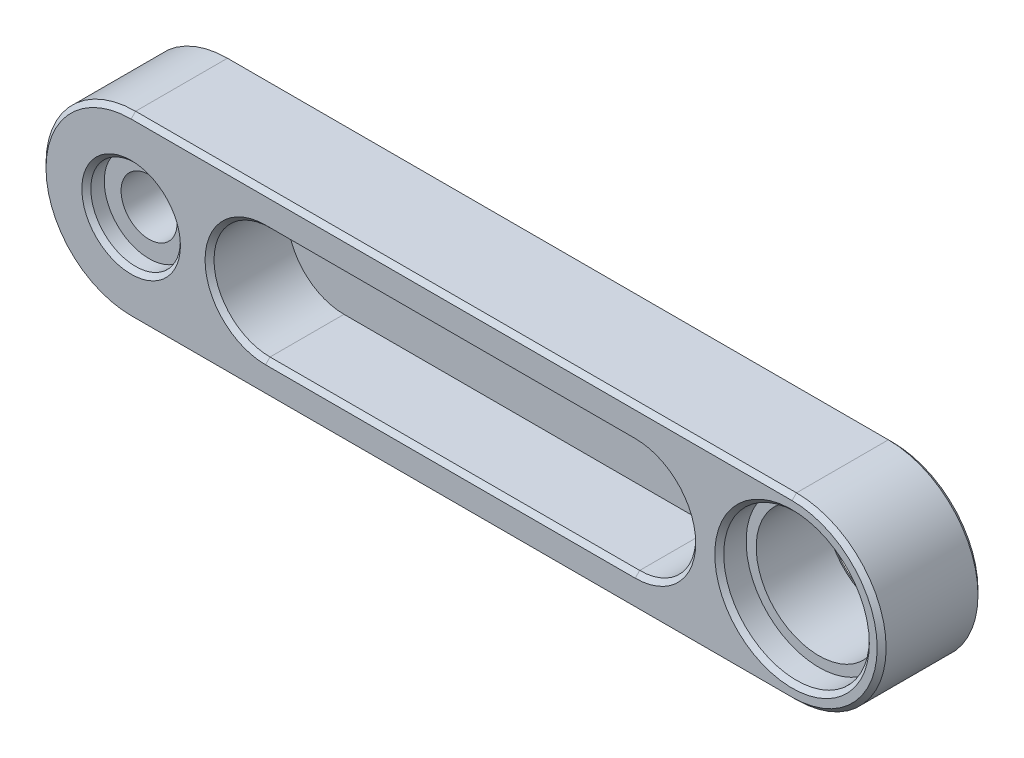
ISO-10303-21;
HEADER;
FILE_DESCRIPTION(('STEP AP214'),'2;1');
FILE_NAME('part.step','',(''),(''),'','','');
FILE_SCHEMA(('AUTOMOTIVE_DESIGN { 1 0 10303 214 1 1 1 1 }'));
ENDSEC;
DATA;
#1=APPLICATION_CONTEXT('core data for automotive mechanical design processes');
#2=APPLICATION_PROTOCOL_DEFINITION('international standard','automotive_design',2000,#1);
#3=PRODUCT_CONTEXT('',#1,'mechanical');
#4=PRODUCT('Part','Part','',(#3));
#5=PRODUCT_RELATED_PRODUCT_CATEGORY('part','',(#4));
#6=PRODUCT_DEFINITION_FORMATION('','',#4);
#7=PRODUCT_DEFINITION_CONTEXT('part definition',#1,'design');
#8=PRODUCT_DEFINITION('design','',#6,#7);
#9=PRODUCT_DEFINITION_SHAPE('','',#8);
#10=(LENGTH_UNIT() NAMED_UNIT(*) SI_UNIT(.MILLI.,.METRE.));
#11=(NAMED_UNIT(*) PLANE_ANGLE_UNIT() SI_UNIT($,.RADIAN.));
#12=(NAMED_UNIT(*) SI_UNIT($,.STERADIAN.) SOLID_ANGLE_UNIT());
#13=UNCERTAINTY_MEASURE_WITH_UNIT(LENGTH_MEASURE(1.E-05),#10,'distance_accuracy_value','');
#14=(GEOMETRIC_REPRESENTATION_CONTEXT(3) GLOBAL_UNCERTAINTY_ASSIGNED_CONTEXT((#13)) GLOBAL_UNIT_ASSIGNED_CONTEXT((#10,
#11,#12)) REPRESENTATION_CONTEXT('',''));
#15=CARTESIAN_POINT('',(0.,0.,0.));
#16=DIRECTION('',(0.,0.,1.));
#17=DIRECTION('',(1.,0.,0.));
#18=AXIS2_PLACEMENT_3D('',#15,#16,#17);
#19=CARTESIAN_POINT('',(0.,0.,1.));
#20=DIRECTION('',(0.,0.,1.));
#21=DIRECTION('',(1.,0.,0.));
#22=AXIS2_PLACEMENT_3D('',#19,#20,#21);
#23=PLANE('',#22);
#24=CARTESIAN_POINT('',(22.5,0.,1.));
#25=DIRECTION('',(0.,0.,1.));
#26=DIRECTION('',(1.,0.,0.));
#27=AXIS2_PLACEMENT_3D('',#24,#25,#26);
#28=CIRCLE('',#27,2.5);
#29=CARTESIAN_POINT('',(22.5,-2.5,1.));
#30=VERTEX_POINT('',#29);
#31=CARTESIAN_POINT('',(22.5,2.5,1.));
#32=VERTEX_POINT('',#31);
#33=EDGE_CURVE('E20',#30,#32,#28,.T.);
#34=ORIENTED_EDGE('',*,*,#33,.T.);
#35=DIRECTION('',(1.,0.,0.));
#36=VECTOR('',#35,1.);
#37=CARTESIAN_POINT('',(6.,2.5,1.));
#38=LINE('',#37,#36);
#39=CARTESIAN_POINT('',(6.,2.5,1.));
#40=VERTEX_POINT('',#39);
#41=EDGE_CURVE('E107',#32,#40,#38,.F.);
#42=ORIENTED_EDGE('',*,*,#41,.T.);
#43=CARTESIAN_POINT('',(6.,0.,1.));
#44=DIRECTION('',(0.,0.,1.));
#45=DIRECTION('',(1.,0.,0.));
#46=AXIS2_PLACEMENT_3D('',#43,#44,#45);
#47=CIRCLE('',#46,2.5);
#48=CARTESIAN_POINT('',(6.,-2.5,1.));
#49=VERTEX_POINT('',#48);
#50=EDGE_CURVE('E102',#40,#49,#47,.T.);
#51=ORIENTED_EDGE('',*,*,#50,.T.);
#52=DIRECTION('',(1.,0.,0.));
#53=VECTOR('',#52,1.);
#54=CARTESIAN_POINT('',(6.,-2.5,1.));
#55=LINE('',#54,#53);
#56=EDGE_CURVE('E95',#49,#30,#55,.T.);
#57=ORIENTED_EDGE('',*,*,#56,.T.);
#58=EDGE_LOOP('',(#34,#42,#51,#57));
#59=FACE_BOUND('',#58,.T.);
#60=ADVANCED_FACE('F17',(#59),#23,.T.);
#61=CARTESIAN_POINT('',(22.5,0.,-22.0737400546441));
#62=DIRECTION('',(0.,0.,1.));
#63=DIRECTION('',(1.,0.,0.));
#64=AXIS2_PLACEMENT_3D('',#61,#62,#63);
#65=CYLINDRICAL_SURFACE('',#64,2.5);
#66=ORIENTED_EDGE('',*,*,#33,.F.);
#67=DIRECTION('',(0.,0.,-1.));
#68=VECTOR('',#67,1.);
#69=CARTESIAN_POINT('',(22.5,-2.5,-22.0737400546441));
#70=LINE('',#69,#68);
#71=CARTESIAN_POINT('',(22.5,-2.49999999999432,4.30000000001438));
#72=VERTEX_POINT('',#71);
#73=EDGE_CURVE('E87',#30,#72,#70,.F.);
#74=ORIENTED_EDGE('',*,*,#73,.T.);
#75=CARTESIAN_POINT('',(22.5,0.,4.30000000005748));
#76=DIRECTION('',(0.,0.,1.));
#77=DIRECTION('',(1.,0.,0.));
#78=AXIS2_PLACEMENT_3D('',#75,#76,#77);
#79=CIRCLE('',#78,2.49999999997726);
#80=CARTESIAN_POINT('',(22.5,2.49999999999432,4.30000000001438));
#81=VERTEX_POINT('',#80);
#82=EDGE_CURVE('E168',#72,#81,#79,.T.);
#83=ORIENTED_EDGE('',*,*,#82,.T.);
#84=DIRECTION('',(0.,0.,1.));
#85=VECTOR('',#84,1.);
#86=CARTESIAN_POINT('',(22.5,2.5,-22.0737400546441));
#87=LINE('',#86,#85);
#88=EDGE_CURVE('E90',#81,#32,#87,.F.);
#89=ORIENTED_EDGE('',*,*,#88,.T.);
#90=EDGE_LOOP('',(#66,#74,#83,#89));
#91=FACE_BOUND('',#90,.T.);
#92=ADVANCED_FACE('F85',(#91),#65,.F.);
#93=CARTESIAN_POINT('',(6.,-2.5,-22.0737400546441));
#94=DIRECTION('',(0.,-1.,0.));
#95=DIRECTION('',(0.,0.,-1.));
#96=AXIS2_PLACEMENT_3D('',#93,#94,#95);
#97=PLANE('',#96);
#98=DIRECTION('',(1.,0.,0.));
#99=VECTOR('',#98,1.);
#100=CARTESIAN_POINT('',(6.,-2.5,4.30000000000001));
#101=LINE('',#100,#99);
#102=CARTESIAN_POINT('',(6.,-2.50000000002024,4.2999999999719));
#103=VERTEX_POINT('',#102);
#104=EDGE_CURVE('E101',#72,#103,#101,.F.);
#105=ORIENTED_EDGE('',*,*,#104,.F.);
#106=ORIENTED_EDGE('',*,*,#73,.F.);
#107=ORIENTED_EDGE('',*,*,#56,.F.);
#108=DIRECTION('',(0.,0.,1.));
#109=VECTOR('',#108,1.);
#110=CARTESIAN_POINT('',(6.,-2.5,-22.0737400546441));
#111=LINE('',#110,#109);
#112=EDGE_CURVE('E155',#49,#103,#111,.T.);
#113=ORIENTED_EDGE('',*,*,#112,.T.);
#114=EDGE_LOOP('',(#105,#106,#107,#113));
#115=FACE_BOUND('',#114,.T.);
#116=ADVANCED_FACE('F97',(#115),#97,.F.);
#117=CARTESIAN_POINT('',(6.,0.,-22.0737400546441));
#118=DIRECTION('',(0.,0.,1.));
#119=DIRECTION('',(1.,0.,0.));
#120=AXIS2_PLACEMENT_3D('',#117,#118,#119);
#121=CYLINDRICAL_SURFACE('',#120,2.5);
#122=CARTESIAN_POINT('',(6.,0.,4.29999999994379));
#123=DIRECTION('',(0.,0.,1.));
#124=DIRECTION('',(1.,0.,0.));
#125=AXIS2_PLACEMENT_3D('',#122,#123,#124);
#126=CIRCLE('',#125,2.50000000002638);
#127=CARTESIAN_POINT('',(6.,2.50000000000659,4.29999999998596));
#128=VERTEX_POINT('',#127);
#129=EDGE_CURVE('E183',#128,#103,#126,.T.);
#130=ORIENTED_EDGE('',*,*,#129,.T.);
#131=ORIENTED_EDGE('',*,*,#112,.F.);
#132=ORIENTED_EDGE('',*,*,#50,.F.);
#133=DIRECTION('',(0.,0.,1.));
#134=VECTOR('',#133,1.);
#135=CARTESIAN_POINT('',(6.,2.5,-22.0737400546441));
#136=LINE('',#135,#134);
#137=EDGE_CURVE('E159',#40,#128,#136,.T.);
#138=ORIENTED_EDGE('',*,*,#137,.T.);
#139=EDGE_LOOP('',(#130,#131,#132,#138));
#140=FACE_BOUND('',#139,.T.);
#141=ADVANCED_FACE('F665',(#140),#121,.F.);
#142=CARTESIAN_POINT('',(6.,2.5,-22.0737400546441));
#143=DIRECTION('',(0.,1.,0.));
#144=DIRECTION('',(0.,0.,1.));
#145=AXIS2_PLACEMENT_3D('',#142,#143,#144);
#146=PLANE('',#145);
#147=DIRECTION('',(1.,0.,0.));
#148=VECTOR('',#147,1.);
#149=CARTESIAN_POINT('',(6.,2.5,4.30000000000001));
#150=LINE('',#149,#148);
#151=EDGE_CURVE('E154',#128,#81,#150,.T.);
#152=ORIENTED_EDGE('',*,*,#151,.F.);
#153=ORIENTED_EDGE('',*,*,#137,.F.);
#154=ORIENTED_EDGE('',*,*,#41,.F.);
#155=ORIENTED_EDGE('',*,*,#88,.F.);
#156=EDGE_LOOP('',(#152,#153,#154,#155));
#157=FACE_BOUND('',#156,.T.);
#158=ADVANCED_FACE('F657',(#157),#146,.F.);
#159=CARTESIAN_POINT('',(22.5,0.,4.49999999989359));
#160=DIRECTION('',(0.,0.,1.));
#161=DIRECTION('',(1.,0.,0.));
#162=AXIS2_PLACEMENT_3D('',#159,#160,#161);
#163=CONICAL_SURFACE('',#162,2.69999999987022,0.785398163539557);
#164=ORIENTED_EDGE('',*,*,#82,.F.);
#165=DIRECTION('',(0.,-0.707106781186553,0.707106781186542));
#166=VECTOR('',#165,1.);
#167=CARTESIAN_POINT('',(22.5,-2.5,4.30000000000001));
#168=LINE('',#167,#166);
#169=CARTESIAN_POINT('',(22.5,-2.69999999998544,4.49999999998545));
#170=VERTEX_POINT('',#169);
#171=EDGE_CURVE('E169',#170,#72,#168,.F.);
#172=ORIENTED_EDGE('',*,*,#171,.F.);
#173=CARTESIAN_POINT('',(22.5,0.,4.4999999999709));
#174=DIRECTION('',(0.,0.,1.));
#175=DIRECTION('',(1.,0.,0.));
#176=AXIS2_PLACEMENT_3D('',#173,#174,#175);
#177=CIRCLE('',#176,2.69999999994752);
#178=CARTESIAN_POINT('',(22.5,2.69999999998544,4.49999999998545));
#179=VERTEX_POINT('',#178);
#180=EDGE_CURVE('E153',#179,#170,#177,.F.);
#181=ORIENTED_EDGE('',*,*,#180,.F.);
#182=DIRECTION('',(0.,-0.707106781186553,-0.707106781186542));
#183=VECTOR('',#182,1.);
#184=CARTESIAN_POINT('',(22.5,2.5,4.30000000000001));
#185=LINE('',#184,#183);
#186=EDGE_CURVE('E191',#81,#179,#185,.F.);
#187=ORIENTED_EDGE('',*,*,#186,.F.);
#188=EDGE_LOOP('',(#164,#172,#181,#187));
#189=FACE_BOUND('',#188,.T.);
#190=ADVANCED_FACE('F368',(#189),#163,.F.);
#191=CARTESIAN_POINT('',(6.,-2.5,4.30000000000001));
#192=DIRECTION('',(0.,0.707106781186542,0.707106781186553));
#193=DIRECTION('',(0.,-0.707106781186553,0.707106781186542));
#194=AXIS2_PLACEMENT_3D('',#191,#192,#193);
#195=PLANE('',#194);
#196=ORIENTED_EDGE('',*,*,#171,.T.);
#197=ORIENTED_EDGE('',*,*,#104,.T.);
#198=DIRECTION('',(0.,0.707106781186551,-0.707106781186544));
#199=VECTOR('',#198,1.);
#200=CARTESIAN_POINT('',(5.99999999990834,-498994.,498995.799999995));
#201=LINE('',#200,#199);
#202=CARTESIAN_POINT('',(6.,-2.7000000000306,4.49999999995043));
#203=VERTEX_POINT('',#202);
#204=EDGE_CURVE('E187',#103,#203,#201,.F.);
#205=ORIENTED_EDGE('',*,*,#204,.T.);
#206=DIRECTION('',(1.,0.,0.));
#207=VECTOR('',#206,1.);
#208=CARTESIAN_POINT('',(0.,-2.69999999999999,4.5));
#209=LINE('',#208,#207);
#210=EDGE_CURVE('E152',#170,#203,#209,.F.);
#211=ORIENTED_EDGE('',*,*,#210,.F.);
#212=EDGE_LOOP('',(#196,#197,#205,#211));
#213=FACE_BOUND('',#212,.T.);
#214=ADVANCED_FACE('F370',(#213),#195,.T.);
#215=CARTESIAN_POINT('',(6.,0.,4.49999999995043));
#216=DIRECTION('',(0.,0.,1.));
#217=DIRECTION('',(1.,0.,0.));
#218=AXIS2_PLACEMENT_3D('',#215,#216,#217);
#219=CONICAL_SURFACE('',#218,2.70000000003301,0.785398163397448);
#220=CARTESIAN_POINT('',(6.,0.,4.49999999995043));
#221=DIRECTION('',(0.,0.,1.));
#222=DIRECTION('',(1.,0.,0.));
#223=AXIS2_PLACEMENT_3D('',#220,#221,#222);
#224=CIRCLE('',#223,2.70000000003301);
#225=CARTESIAN_POINT('',(6.,2.69999999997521,4.49999999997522));
#226=VERTEX_POINT('',#225);
#227=EDGE_CURVE('E150',#203,#226,#224,.F.);
#228=ORIENTED_EDGE('',*,*,#227,.F.);
#229=ORIENTED_EDGE('',*,*,#204,.F.);
#230=ORIENTED_EDGE('',*,*,#129,.F.);
#231=DIRECTION('',(0.,-0.707106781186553,-0.707106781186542));
#232=VECTOR('',#231,1.);
#233=CARTESIAN_POINT('',(6.,2.5,4.30000000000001));
#234=LINE('',#233,#232);
#235=EDGE_CURVE('E200',#226,#128,#234,.T.);
#236=ORIENTED_EDGE('',*,*,#235,.F.);
#237=EDGE_LOOP('',(#228,#229,#230,#236));
#238=FACE_BOUND('',#237,.T.);
#239=ADVANCED_FACE('F378',(#238),#219,.F.);
#240=CARTESIAN_POINT('',(6.,2.5,4.30000000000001));
#241=DIRECTION('',(0.,-0.707106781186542,0.707106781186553));
#242=DIRECTION('',(0.,-0.707106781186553,-0.707106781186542));
#243=AXIS2_PLACEMENT_3D('',#240,#241,#242);
#244=PLANE('',#243);
#245=ORIENTED_EDGE('',*,*,#235,.T.);
#246=ORIENTED_EDGE('',*,*,#151,.T.);
#247=ORIENTED_EDGE('',*,*,#186,.T.);
#248=DIRECTION('',(1.,0.,0.));
#249=VECTOR('',#248,1.);
#250=CARTESIAN_POINT('',(0.,2.69999999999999,4.5));
#251=LINE('',#250,#249);
#252=EDGE_CURVE('E149',#226,#179,#251,.T.);
#253=ORIENTED_EDGE('',*,*,#252,.F.);
#254=EDGE_LOOP('',(#245,#246,#247,#253));
#255=FACE_BOUND('',#254,.T.);
#256=ADVANCED_FACE('F375',(#255),#244,.T.);
#257=CARTESIAN_POINT('',(29.5,0.,4.50000000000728));
#258=DIRECTION('',(0.,0.,1.));
#259=DIRECTION('',(1.,0.,0.));
#260=AXIS2_PLACEMENT_3D('',#257,#258,#259);
#261=CONICAL_SURFACE('',#260,3.45000000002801,0.785398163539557);
#262=CARTESIAN_POINT('',(29.5,0.,4.4999999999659));
#263=DIRECTION('',(0.,0.,1.));
#264=DIRECTION('',(1.,0.,0.));
#265=AXIS2_PLACEMENT_3D('',#262,#263,#264);
#266=CIRCLE('',#265,3.44999999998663);
#267=CARTESIAN_POINT('',(32.9499999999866,0.,4.4999999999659));
#268=VERTEX_POINT('',#267);
#269=EDGE_CURVE('E142',#268,#268,#266,.F.);
#270=ORIENTED_EDGE('',*,*,#269,.F.);
#271=EDGE_LOOP('',(#270));
#272=FACE_BOUND('',#271,.T.);
#273=CARTESIAN_POINT('',(29.5,0.,4.30000000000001));
#274=DIRECTION('',(0.,0.,1.));
#275=DIRECTION('',(1.,0.,0.));
#276=AXIS2_PLACEMENT_3D('',#273,#274,#275);
#277=CIRCLE('',#276,3.25);
#278=CARTESIAN_POINT('',(32.75,0.,4.30000000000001));
#279=VERTEX_POINT('',#278);
#280=EDGE_CURVE('E145',#279,#279,#277,.F.);
#281=ORIENTED_EDGE('',*,*,#280,.T.);
#282=EDGE_LOOP('',(#281));
#283=FACE_BOUND('',#282,.T.);
#284=ADVANCED_FACE('F377',(#272,#283),#261,.F.);
#285=CARTESIAN_POINT('',(0.,0.,4.50000000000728));
#286=DIRECTION('',(0.,0.,1.));
#287=DIRECTION('',(1.,0.,0.));
#288=AXIS2_PLACEMENT_3D('',#285,#286,#287);
#289=CONICAL_SURFACE('',#288,2.19999999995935,0.785398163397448);
#290=CARTESIAN_POINT('',(0.,0.,4.50000000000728));
#291=DIRECTION('',(0.,0.,1.));
#292=DIRECTION('',(1.,0.,0.));
#293=AXIS2_PLACEMENT_3D('',#290,#291,#292);
#294=CIRCLE('',#293,2.19999999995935);
#295=CARTESIAN_POINT('',(2.19999999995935,0.,4.50000000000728));
#296=VERTEX_POINT('',#295);
#297=EDGE_CURVE('E146',#296,#296,#294,.F.);
#298=ORIENTED_EDGE('',*,*,#297,.F.);
#299=EDGE_LOOP('',(#298));
#300=FACE_BOUND('',#299,.T.);
#301=CARTESIAN_POINT('',(0.,0.,4.3));
#302=DIRECTION('',(0.,0.,1.));
#303=DIRECTION('',(1.,0.,0.));
#304=AXIS2_PLACEMENT_3D('',#301,#302,#303);
#305=CIRCLE('',#304,2.);
#306=CARTESIAN_POINT('',(2.,0.,4.3));
#307=VERTEX_POINT('',#306);
#308=EDGE_CURVE('E219',#307,#307,#305,.F.);
#309=ORIENTED_EDGE('',*,*,#308,.T.);
#310=EDGE_LOOP('',(#309));
#311=FACE_BOUND('',#310,.T.);
#312=ADVANCED_FACE('F385',(#300,#311),#289,.F.);
#313=CARTESIAN_POINT('',(0.,0.,4.5));
#314=DIRECTION('',(0.,0.,1.));
#315=DIRECTION('',(1.,0.,0.));
#316=AXIS2_PLACEMENT_3D('',#313,#314,#315);
#317=PLANE('',#316);
#318=ORIENTED_EDGE('',*,*,#269,.T.);
#319=EDGE_LOOP('',(#318));
#320=FACE_BOUND('',#319,.T.);
#321=ORIENTED_EDGE('',*,*,#297,.T.);
#322=EDGE_LOOP('',(#321));
#323=FACE_BOUND('',#322,.T.);
#324=ORIENTED_EDGE('',*,*,#227,.T.);
#325=ORIENTED_EDGE('',*,*,#252,.T.);
#326=ORIENTED_EDGE('',*,*,#180,.T.);
#327=ORIENTED_EDGE('',*,*,#210,.T.);
#328=EDGE_LOOP('',(#324,#325,#326,#327));
#329=FACE_BOUND('',#328,.T.);
#330=CARTESIAN_POINT('',(0.,0.,4.50000000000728));
#331=DIRECTION('',(0.,0.,-1.));
#332=DIRECTION('',(-1.,0.,0.));
#333=AXIS2_PLACEMENT_3D('',#330,#331,#332);
#334=CIRCLE('',#333,3.80000000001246);
#335=CARTESIAN_POINT('',(0.,-3.79999999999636,4.50000000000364));
#336=VERTEX_POINT('',#335);
#337=CARTESIAN_POINT('',(0.,3.80000000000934,4.50000000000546));
#338=VERTEX_POINT('',#337);
#339=EDGE_CURVE('E138',#336,#338,#334,.T.);
#340=ORIENTED_EDGE('',*,*,#339,.F.);
#341=DIRECTION('',(1.,0.,0.));
#342=VECTOR('',#341,1.);
#343=CARTESIAN_POINT('',(0.,-3.79999999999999,4.5));
#344=LINE('',#343,#342);
#345=CARTESIAN_POINT('',(29.5,-3.79999999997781,4.50000000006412));
#346=VERTEX_POINT('',#345);
#347=EDGE_CURVE('E222',#346,#336,#344,.F.);
#348=ORIENTED_EDGE('',*,*,#347,.F.);
#349=CARTESIAN_POINT('',(29.5,0.,4.50000000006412));
#350=DIRECTION('',(0.,0.,-1.));
#351=DIRECTION('',(-1.,0.,0.));
#352=AXIS2_PLACEMENT_3D('',#349,#350,#351);
#353=CIRCLE('',#352,3.79999999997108);
#354=CARTESIAN_POINT('',(29.5,3.79999999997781,4.50000000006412));
#355=VERTEX_POINT('',#354);
#356=EDGE_CURVE('E134',#355,#346,#353,.T.);
#357=ORIENTED_EDGE('',*,*,#356,.F.);
#358=DIRECTION('',(1.,0.,0.));
#359=VECTOR('',#358,1.);
#360=CARTESIAN_POINT('',(0.,3.79999999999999,4.5));
#361=LINE('',#360,#359);
#362=EDGE_CURVE('E141',#338,#355,#361,.T.);
#363=ORIENTED_EDGE('',*,*,#362,.F.);
#364=EDGE_LOOP('',(#340,#348,#357,#363));
#365=FACE_BOUND('',#364,.T.);
#366=ADVANCED_FACE('F373',(#320,#323,#329,#365),#317,.T.);
#367=CARTESIAN_POINT('',(29.5,0.,3.5));
#368=DIRECTION('',(0.,0.,1.));
#369=DIRECTION('',(1.,0.,0.));
#370=AXIS2_PLACEMENT_3D('',#367,#368,#369);
#371=CYLINDRICAL_SURFACE('',#370,3.25);
#372=ORIENTED_EDGE('',*,*,#280,.F.);
#373=EDGE_LOOP('',(#372));
#374=FACE_BOUND('',#373,.T.);
#375=CARTESIAN_POINT('',(29.5,0.,3.3));
#376=DIRECTION('',(0.,0.,1.));
#377=DIRECTION('',(1.,0.,0.));
#378=AXIS2_PLACEMENT_3D('',#375,#376,#377);
#379=CIRCLE('',#378,3.25);
#380=CARTESIAN_POINT('',(32.75,0.,3.3));
#381=VERTEX_POINT('',#380);
#382=EDGE_CURVE('E131',#381,#381,#379,.T.);
#383=ORIENTED_EDGE('',*,*,#382,.F.);
#384=EDGE_LOOP('',(#383));
#385=FACE_BOUND('',#384,.T.);
#386=ADVANCED_FACE('F465',(#374,#385),#371,.F.);
#387=CARTESIAN_POINT('',(0.,0.,3.7));
#388=DIRECTION('',(0.,0.,1.));
#389=DIRECTION('',(1.,0.,0.));
#390=AXIS2_PLACEMENT_3D('',#387,#388,#389);
#391=CYLINDRICAL_SURFACE('',#390,2.);
#392=ORIENTED_EDGE('',*,*,#308,.F.);
#393=EDGE_LOOP('',(#392));
#394=FACE_BOUND('',#393,.T.);
#395=CARTESIAN_POINT('',(0.,0.,3.7));
#396=DIRECTION('',(0.,0.,1.));
#397=DIRECTION('',(1.,0.,0.));
#398=AXIS2_PLACEMENT_3D('',#395,#396,#397);
#399=CIRCLE('',#398,2.);
#400=CARTESIAN_POINT('',(2.,0.,3.7));
#401=VERTEX_POINT('',#400);
#402=EDGE_CURVE('E127',#401,#401,#399,.T.);
#403=ORIENTED_EDGE('',*,*,#402,.F.);
#404=EDGE_LOOP('',(#403));
#405=FACE_BOUND('',#404,.T.);
#406=ADVANCED_FACE('F461',(#394,#405),#391,.F.);
#407=CARTESIAN_POINT('',(0.,3.79999999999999,4.5));
#408=DIRECTION('',(0.,0.707106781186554,0.707106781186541));
#409=DIRECTION('',(0.,-0.707106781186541,0.707106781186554));
#410=AXIS2_PLACEMENT_3D('',#407,#408,#409);
#411=PLANE('',#410);
#412=DIRECTION('',(0.,-0.707106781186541,0.707106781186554));
#413=VECTOR('',#412,1.);
#414=CARTESIAN_POINT('',(-3.05549376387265E-11,499000.,-498991.700000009));
#415=LINE('',#414,#413);
#416=CARTESIAN_POINT('',(0.,3.99999999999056,4.30000000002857));
#417=VERTEX_POINT('',#416);
#418=EDGE_CURVE('E140',#338,#417,#415,.F.);
#419=ORIENTED_EDGE('',*,*,#418,.F.);
#420=ORIENTED_EDGE('',*,*,#362,.T.);
#421=DIRECTION('',(0.,-0.707106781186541,0.707106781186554));
#422=VECTOR('',#421,1.);
#423=CARTESIAN_POINT('',(29.4999999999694,499008.299999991,-499000.));
#424=LINE('',#423,#422);
#425=CARTESIAN_POINT('',(29.5,4.00000000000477,4.30000000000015));
#426=VERTEX_POINT('',#425);
#427=EDGE_CURVE('E137',#426,#355,#424,.T.);
#428=ORIENTED_EDGE('',*,*,#427,.F.);
#429=DIRECTION('',(1.,0.,0.));
#430=VECTOR('',#429,1.);
#431=CARTESIAN_POINT('',(0.,4.,4.29999999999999));
#432=LINE('',#431,#430);
#433=EDGE_CURVE('E130',#426,#417,#432,.F.);
#434=ORIENTED_EDGE('',*,*,#433,.T.);
#435=EDGE_LOOP('',(#419,#420,#428,#434));
#436=FACE_BOUND('',#435,.T.);
#437=ADVANCED_FACE('F457',(#436),#411,.T.);
#438=CARTESIAN_POINT('',(0.,0.,4.30000000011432));
#439=DIRECTION('',(0.,0.,-1.));
#440=DIRECTION('',(-1.,0.,0.));
#441=AXIS2_PLACEMENT_3D('',#438,#439,#440);
#442=CONICAL_SURFACE('',#441,3.99999999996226,0.785398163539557);
#443=ORIENTED_EDGE('',*,*,#418,.T.);
#444=CARTESIAN_POINT('',(0.,0.,4.29999999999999));
#445=DIRECTION('',(0.,0.,-1.));
#446=DIRECTION('',(-1.,0.,0.));
#447=AXIS2_PLACEMENT_3D('',#444,#445,#446);
#448=CIRCLE('',#447,4.);
#449=CARTESIAN_POINT('',(0.,-4.,4.29999999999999));
#450=VERTEX_POINT('',#449);
#451=EDGE_CURVE('E237',#450,#417,#448,.T.);
#452=ORIENTED_EDGE('',*,*,#451,.F.);
#453=DIRECTION('',(0.,-0.707106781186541,-0.707106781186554));
#454=VECTOR('',#453,1.);
#455=CARTESIAN_POINT('',(0.,-3.79999999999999,4.5));
#456=LINE('',#455,#454);
#457=EDGE_CURVE('E226',#336,#450,#456,.T.);
#458=ORIENTED_EDGE('',*,*,#457,.F.);
#459=ORIENTED_EDGE('',*,*,#339,.T.);
#460=EDGE_LOOP('',(#443,#452,#458,#459));
#461=FACE_BOUND('',#460,.T.);
#462=ADVANCED_FACE('F453',(#461),#442,.T.);
#463=CARTESIAN_POINT('',(0.,-3.79999999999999,4.5));
#464=DIRECTION('',(0.,-0.707106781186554,0.707106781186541));
#465=DIRECTION('',(0.,-0.707106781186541,-0.707106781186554));
#466=AXIS2_PLACEMENT_3D('',#463,#464,#465);
#467=PLANE('',#466);
#468=DIRECTION('',(0.,0.707106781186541,0.707106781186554));
#469=VECTOR('',#468,1.);
#470=CARTESIAN_POINT('',(29.5000000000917,-499008.299999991,-499000.));
#471=LINE('',#470,#469);
#472=CARTESIAN_POINT('',(29.5,-4.00000000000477,4.30000000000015));
#473=VERTEX_POINT('',#472);
#474=EDGE_CURVE('E225',#346,#473,#471,.F.);
#475=ORIENTED_EDGE('',*,*,#474,.F.);
#476=ORIENTED_EDGE('',*,*,#347,.T.);
#477=ORIENTED_EDGE('',*,*,#457,.T.);
#478=DIRECTION('',(1.,0.,0.));
#479=VECTOR('',#478,1.);
#480=CARTESIAN_POINT('',(0.,-4.,4.29999999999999));
#481=LINE('',#480,#479);
#482=EDGE_CURVE('E251',#450,#473,#481,.T.);
#483=ORIENTED_EDGE('',*,*,#482,.T.);
#484=EDGE_LOOP('',(#475,#476,#477,#483));
#485=FACE_BOUND('',#484,.T.);
#486=ADVANCED_FACE('F449',(#485),#467,.T.);
#487=CARTESIAN_POINT('',(29.5,0.,4.30000000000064));
#488=DIRECTION('',(0.,0.,-1.));
#489=DIRECTION('',(-1.,0.,0.));
#490=AXIS2_PLACEMENT_3D('',#487,#488,#489);
#491=CONICAL_SURFACE('',#490,4.00000000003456,0.785398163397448);
#492=ORIENTED_EDGE('',*,*,#427,.T.);
#493=ORIENTED_EDGE('',*,*,#356,.T.);
#494=ORIENTED_EDGE('',*,*,#474,.T.);
#495=CARTESIAN_POINT('',(29.5,0.,4.29999999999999));
#496=DIRECTION('',(0.,0.,-1.));
#497=DIRECTION('',(-1.,0.,0.));
#498=AXIS2_PLACEMENT_3D('',#495,#496,#497);
#499=CIRCLE('',#498,4.);
#500=EDGE_CURVE('E126',#426,#473,#499,.T.);
#501=ORIENTED_EDGE('',*,*,#500,.F.);
#502=EDGE_LOOP('',(#492,#493,#494,#501));
#503=FACE_BOUND('',#502,.T.);
#504=ADVANCED_FACE('F445',(#503),#491,.T.);
#505=CARTESIAN_POINT('',(29.5,0.,3.3));
#506=DIRECTION('',(0.,0.,1.));
#507=DIRECTION('',(1.,0.,0.));
#508=AXIS2_PLACEMENT_3D('',#505,#506,#507);
#509=PLANE('',#508);
#510=CARTESIAN_POINT('',(29.5,0.,3.3));
#511=DIRECTION('',(0.,0.,1.));
#512=DIRECTION('',(1.,0.,0.));
#513=AXIS2_PLACEMENT_3D('',#510,#511,#512);
#514=CIRCLE('',#513,2.8);
#515=CARTESIAN_POINT('',(32.3,0.,3.3));
#516=VERTEX_POINT('',#515);
#517=EDGE_CURVE('E123',#516,#516,#514,.F.);
#518=ORIENTED_EDGE('',*,*,#517,.T.);
#519=EDGE_LOOP('',(#518));
#520=FACE_BOUND('',#519,.T.);
#521=ORIENTED_EDGE('',*,*,#382,.T.);
#522=EDGE_LOOP('',(#521));
#523=FACE_BOUND('',#522,.T.);
#524=ADVANCED_FACE('F441',(#520,#523),#509,.T.);
#525=CARTESIAN_POINT('',(0.,0.,3.7));
#526=DIRECTION('',(0.,0.,1.));
#527=DIRECTION('',(1.,0.,0.));
#528=AXIS2_PLACEMENT_3D('',#525,#526,#527);
#529=PLANE('',#528);
#530=ORIENTED_EDGE('',*,*,#402,.T.);
#531=EDGE_LOOP('',(#530));
#532=FACE_BOUND('',#531,.T.);
#533=CARTESIAN_POINT('',(0.,0.,3.7));
#534=DIRECTION('',(0.,0.,1.));
#535=DIRECTION('',(1.,0.,0.));
#536=AXIS2_PLACEMENT_3D('',#533,#534,#535);
#537=CIRCLE('',#536,1.24999999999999);
#538=CARTESIAN_POINT('',(1.24999999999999,0.,3.7));
#539=VERTEX_POINT('',#538);
#540=EDGE_CURVE('E119',#539,#539,#537,.F.);
#541=ORIENTED_EDGE('',*,*,#540,.T.);
#542=EDGE_LOOP('',(#541));
#543=FACE_BOUND('',#542,.T.);
#544=ADVANCED_FACE('F437',(#532,#543),#529,.T.);
#545=CARTESIAN_POINT('',(0.,4.,4.5));
#546=DIRECTION('',(0.,-1.,0.));
#547=DIRECTION('',(0.,0.,-1.));
#548=AXIS2_PLACEMENT_3D('',#545,#546,#547);
#549=PLANE('',#548);
#550=DIRECTION('',(1.,0.,0.));
#551=VECTOR('',#550,1.);
#552=CARTESIAN_POINT('',(0.,4.,0.200000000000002));
#553=LINE('',#552,#551);
#554=CARTESIAN_POINT('',(29.5,3.99999999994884,0.199999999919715));
#555=VERTEX_POINT('',#554);
#556=CARTESIAN_POINT('',(0.,4.00000000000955,0.200000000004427));
#557=VERTEX_POINT('',#556);
#558=EDGE_CURVE('E122',#555,#557,#553,.F.);
#559=ORIENTED_EDGE('',*,*,#558,.T.);
#560=DIRECTION('',(0.,0.,-1.));
#561=VECTOR('',#560,1.);
#562=CARTESIAN_POINT('',(0.,4.,4.5));
#563=LINE('',#562,#561);
#564=EDGE_CURVE('E240',#417,#557,#563,.T.);
#565=ORIENTED_EDGE('',*,*,#564,.F.);
#566=ORIENTED_EDGE('',*,*,#433,.F.);
#567=DIRECTION('',(0.,0.,-1.));
#568=VECTOR('',#567,1.);
#569=CARTESIAN_POINT('',(29.5,4.,4.5));
#570=LINE('',#569,#568);
#571=EDGE_CURVE('E259',#555,#426,#570,.F.);
#572=ORIENTED_EDGE('',*,*,#571,.F.);
#573=EDGE_LOOP('',(#559,#565,#566,#572));
#574=FACE_BOUND('',#573,.T.);
#575=ADVANCED_FACE('F434',(#574),#549,.F.);
#576=CARTESIAN_POINT('',(0.,0.,4.5));
#577=DIRECTION('',(0.,0.,-1.));
#578=DIRECTION('',(-1.,0.,0.));
#579=AXIS2_PLACEMENT_3D('',#576,#577,#578);
#580=CYLINDRICAL_SURFACE('',#579,4.);
#581=ORIENTED_EDGE('',*,*,#564,.T.);
#582=CARTESIAN_POINT('',(0.,0.,0.200000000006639));
#583=DIRECTION('',(0.,0.,1.));
#584=DIRECTION('',(1.,0.,0.));
#585=AXIS2_PLACEMENT_3D('',#582,#583,#584);
#586=CIRCLE('',#585,4.0000000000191);
#587=CARTESIAN_POINT('',(0.,-4.00000000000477,0.200000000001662));
#588=VERTEX_POINT('',#587);
#589=EDGE_CURVE('E274',#588,#557,#586,.F.);
#590=ORIENTED_EDGE('',*,*,#589,.F.);
#591=DIRECTION('',(0.,0.,1.));
#592=VECTOR('',#591,1.);
#593=CARTESIAN_POINT('',(0.,-4.,4.5));
#594=LINE('',#593,#592);
#595=EDGE_CURVE('E254',#588,#450,#594,.T.);
#596=ORIENTED_EDGE('',*,*,#595,.T.);
#597=ORIENTED_EDGE('',*,*,#451,.T.);
#598=EDGE_LOOP('',(#581,#590,#596,#597));
#599=FACE_BOUND('',#598,.T.);
#600=ADVANCED_FACE('F430',(#599),#580,.T.);
#601=CARTESIAN_POINT('',(0.,-4.,4.5));
#602=DIRECTION('',(0.,1.,0.));
#603=DIRECTION('',(0.,0.,1.));
#604=AXIS2_PLACEMENT_3D('',#601,#602,#603);
#605=PLANE('',#604);
#606=DIRECTION('',(1.,0.,0.));
#607=VECTOR('',#606,1.);
#608=CARTESIAN_POINT('',(0.,-4.,0.200000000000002));
#609=LINE('',#608,#607);
#610=CARTESIAN_POINT('',(29.5,-3.99999999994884,0.199999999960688));
#611=VERTEX_POINT('',#610);
#612=EDGE_CURVE('E277',#588,#611,#609,.T.);
#613=ORIENTED_EDGE('',*,*,#612,.T.);
#614=DIRECTION('',(0.,0.,-1.));
#615=VECTOR('',#614,1.);
#616=CARTESIAN_POINT('',(29.5,-4.,4.5));
#617=LINE('',#616,#615);
#618=EDGE_CURVE('E283',#473,#611,#617,.T.);
#619=ORIENTED_EDGE('',*,*,#618,.F.);
#620=ORIENTED_EDGE('',*,*,#482,.F.);
#621=ORIENTED_EDGE('',*,*,#595,.F.);
#622=EDGE_LOOP('',(#613,#619,#620,#621));
#623=FACE_BOUND('',#622,.T.);
#624=ADVANCED_FACE('F426',(#623),#605,.F.);
#625=CARTESIAN_POINT('',(29.5,0.,4.5));
#626=DIRECTION('',(0.,0.,-1.));
#627=DIRECTION('',(-1.,0.,0.));
#628=AXIS2_PLACEMENT_3D('',#625,#626,#627);
#629=CYLINDRICAL_SURFACE('',#628,4.);
#630=ORIENTED_EDGE('',*,*,#571,.T.);
#631=ORIENTED_EDGE('',*,*,#500,.T.);
#632=ORIENTED_EDGE('',*,*,#618,.T.);
#633=CARTESIAN_POINT('',(29.5,0.,0.200000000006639));
#634=DIRECTION('',(0.,0.,1.));
#635=DIRECTION('',(1.,0.,0.));
#636=AXIS2_PLACEMENT_3D('',#633,#634,#635);
#637=CIRCLE('',#636,3.99999999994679);
#638=EDGE_CURVE('E295',#555,#611,#637,.F.);
#639=ORIENTED_EDGE('',*,*,#638,.F.);
#640=EDGE_LOOP('',(#630,#631,#632,#639));
#641=FACE_BOUND('',#640,.T.);
#642=ADVANCED_FACE('F422',(#641),#629,.T.);
#643=CARTESIAN_POINT('',(29.5,0.,0.));
#644=DIRECTION('',(0.,0.,1.));
#645=DIRECTION('',(1.,0.,0.));
#646=AXIS2_PLACEMENT_3D('',#643,#644,#645);
#647=CYLINDRICAL_SURFACE('',#646,2.8);
#648=ORIENTED_EDGE('',*,*,#517,.F.);
#649=EDGE_LOOP('',(#648));
#650=FACE_BOUND('',#649,.T.);
#651=CARTESIAN_POINT('',(29.5,0.,0.200000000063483));
#652=DIRECTION('',(0.,0.,-1.));
#653=DIRECTION('',(-1.,0.,0.));
#654=AXIS2_PLACEMENT_3D('',#651,#652,#653);
#655=CIRCLE('',#654,2.79999999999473);
#656=CARTESIAN_POINT('',(26.7000000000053,0.,0.200000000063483));
#657=VERTEX_POINT('',#656);
#658=EDGE_CURVE('E297',#657,#657,#655,.T.);
#659=ORIENTED_EDGE('',*,*,#658,.T.);
#660=EDGE_LOOP('',(#659));
#661=FACE_BOUND('',#660,.T.);
#662=ADVANCED_FACE('F418',(#650,#661),#647,.F.);
#663=CARTESIAN_POINT('',(0.,0.,4.5));
#664=DIRECTION('',(0.,0.,1.));
#665=DIRECTION('',(1.,0.,0.));
#666=AXIS2_PLACEMENT_3D('',#663,#664,#665);
#667=CYLINDRICAL_SURFACE('',#666,1.24999999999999);
#668=ORIENTED_EDGE('',*,*,#540,.F.);
#669=EDGE_LOOP('',(#668));
#670=FACE_BOUND('',#669,.T.);
#671=CARTESIAN_POINT('',(0.,0.,0.200000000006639));
#672=DIRECTION('',(0.,0.,-1.));
#673=DIRECTION('',(-1.,0.,0.));
#674=AXIS2_PLACEMENT_3D('',#671,#672,#673);
#675=CIRCLE('',#674,1.25000000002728);
#676=CARTESIAN_POINT('',(-1.25000000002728,0.,0.200000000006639));
#677=VERTEX_POINT('',#676);
#678=EDGE_CURVE('E309',#677,#677,#675,.T.);
#679=ORIENTED_EDGE('',*,*,#678,.T.);
#680=EDGE_LOOP('',(#679));
#681=FACE_BOUND('',#680,.T.);
#682=ADVANCED_FACE('F415',(#670,#681),#667,.F.);
#683=CARTESIAN_POINT('',(0.,4.,0.200000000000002));
#684=DIRECTION('',(0.,-0.707106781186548,0.707106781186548));
#685=DIRECTION('',(0.,-0.707106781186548,-0.707106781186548));
#686=AXIS2_PLACEMENT_3D('',#683,#684,#685);
#687=PLANE('',#686);
#688=DIRECTION('',(1.,0.,0.));
#689=VECTOR('',#688,1.);
#690=CARTESIAN_POINT('',(0.,3.8,0.));
#691=LINE('',#690,#689);
#692=CARTESIAN_POINT('',(29.5,3.79999999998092,0.));
#693=VERTEX_POINT('',#692);
#694=CARTESIAN_POINT('',(0.,3.79999999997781,0.));
#695=VERTEX_POINT('',#694);
#696=EDGE_CURVE('E118',#693,#695,#691,.F.);
#697=ORIENTED_EDGE('',*,*,#696,.T.);
#698=DIRECTION('',(0.,-0.707106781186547,-0.707106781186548));
#699=VECTOR('',#698,1.);
#700=CARTESIAN_POINT('',(3.05549376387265E-11,499000.,498996.2));
#701=LINE('',#700,#699);
#702=EDGE_CURVE('E278',#557,#695,#701,.T.);
#703=ORIENTED_EDGE('',*,*,#702,.F.);
#704=ORIENTED_EDGE('',*,*,#558,.F.);
#705=DIRECTION('',(0.,-0.707106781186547,-0.707106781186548));
#706=VECTOR('',#705,1.);
#707=CARTESIAN_POINT('',(29.5000000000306,498970.5,498966.700000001));
#708=LINE('',#707,#706);
#709=EDGE_CURVE('E298',#693,#555,#708,.F.);
#710=ORIENTED_EDGE('',*,*,#709,.F.);
#711=EDGE_LOOP('',(#697,#703,#704,#710));
#712=FACE_BOUND('',#711,.T.);
#713=ADVANCED_FACE('F346',(#712),#687,.F.);
#714=CARTESIAN_POINT('',(0.,0.,0.200000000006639));
#715=DIRECTION('',(0.,0.,1.));
#716=DIRECTION('',(1.,0.,0.));
#717=AXIS2_PLACEMENT_3D('',#714,#715,#716);
#718=CONICAL_SURFACE('',#717,4.0000000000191,0.785398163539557);
#719=DIRECTION('',(0.,-0.707106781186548,0.707106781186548));
#720=VECTOR('',#719,1.);
#721=CARTESIAN_POINT('',(0.,-4.,0.200000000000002));
#722=LINE('',#721,#720);
#723=CARTESIAN_POINT('',(0.,-3.8,0.));
#724=VERTEX_POINT('',#723);
#725=EDGE_CURVE('E292',#724,#588,#722,.T.);
#726=ORIENTED_EDGE('',*,*,#725,.T.);
#727=ORIENTED_EDGE('',*,*,#589,.T.);
#728=ORIENTED_EDGE('',*,*,#702,.T.);
#729=CARTESIAN_POINT('',(0.,0.,0.));
#730=DIRECTION('',(0.,0.,1.));
#731=DIRECTION('',(1.,0.,0.));
#732=AXIS2_PLACEMENT_3D('',#729,#730,#731);
#733=CIRCLE('',#732,3.79999999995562);
#734=EDGE_CURVE('E115',#695,#724,#733,.T.);
#735=ORIENTED_EDGE('',*,*,#734,.T.);
#736=EDGE_LOOP('',(#726,#727,#728,#735));
#737=FACE_BOUND('',#736,.T.);
#738=ADVANCED_FACE('F339',(#737),#718,.T.);
#739=CARTESIAN_POINT('',(0.,-4.,0.200000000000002));
#740=DIRECTION('',(0.,0.707106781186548,0.707106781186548));
#741=DIRECTION('',(0.,-0.707106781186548,0.707106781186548));
#742=AXIS2_PLACEMENT_3D('',#739,#740,#741);
#743=PLANE('',#742);
#744=DIRECTION('',(1.,0.,0.));
#745=VECTOR('',#744,1.);
#746=CARTESIAN_POINT('',(0.,-3.8,0.));
#747=LINE('',#746,#745);
#748=CARTESIAN_POINT('',(29.5,-3.79999999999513,1.4210854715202E-11));
#749=VERTEX_POINT('',#748);
#750=EDGE_CURVE('E114',#724,#749,#747,.T.);
#751=ORIENTED_EDGE('',*,*,#750,.T.);
#752=DIRECTION('',(0.,0.707106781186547,-0.707106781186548));
#753=VECTOR('',#752,1.);
#754=CARTESIAN_POINT('',(29.4999999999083,-498970.5,498966.700000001));
#755=LINE('',#754,#753);
#756=EDGE_CURVE('E35',#611,#749,#755,.T.);
#757=ORIENTED_EDGE('',*,*,#756,.F.);
#758=ORIENTED_EDGE('',*,*,#612,.F.);
#759=ORIENTED_EDGE('',*,*,#725,.F.);
#760=EDGE_LOOP('',(#751,#757,#758,#759));
#761=FACE_BOUND('',#760,.T.);
#762=ADVANCED_FACE('F331',(#761),#743,.F.);
#763=CARTESIAN_POINT('',(29.5,0.,0.199999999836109));
#764=DIRECTION('',(0.,0.,1.));
#765=DIRECTION('',(1.,0.,0.));
#766=AXIS2_PLACEMENT_3D('',#763,#764,#765);
#767=CONICAL_SURFACE('',#766,3.99999999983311,0.785398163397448);
#768=ORIENTED_EDGE('',*,*,#709,.T.);
#769=ORIENTED_EDGE('',*,*,#638,.T.);
#770=ORIENTED_EDGE('',*,*,#756,.T.);
#771=CARTESIAN_POINT('',(29.5,0.,5.6843418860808E-11));
#772=DIRECTION('',(0.,0.,1.));
#773=DIRECTION('',(1.,0.,0.));
#774=AXIS2_PLACEMENT_3D('',#771,#772,#773);
#775=CIRCLE('',#774,3.80000000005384);
#776=EDGE_CURVE('E112',#749,#693,#775,.T.);
#777=ORIENTED_EDGE('',*,*,#776,.T.);
#778=EDGE_LOOP('',(#768,#769,#770,#777));
#779=FACE_BOUND('',#778,.T.);
#780=ADVANCED_FACE('F405',(#779),#767,.T.);
#781=CARTESIAN_POINT('',(29.5,0.,0.));
#782=DIRECTION('',(0.,0.,-1.));
#783=DIRECTION('',(-1.,0.,0.));
#784=AXIS2_PLACEMENT_3D('',#781,#782,#783);
#785=CONICAL_SURFACE('',#784,3.00000000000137,0.78539816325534);
#786=CARTESIAN_POINT('',(29.5,0.,0.));
#787=DIRECTION('',(0.,0.,-1.));
#788=DIRECTION('',(-1.,0.,0.));
#789=AXIS2_PLACEMENT_3D('',#786,#787,#788);
#790=CIRCLE('',#789,3.00000000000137);
#791=CARTESIAN_POINT('',(26.4999999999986,0.,0.));
#792=VERTEX_POINT('',#791);
#793=EDGE_CURVE('E26',#792,#792,#790,.T.);
#794=ORIENTED_EDGE('',*,*,#793,.T.);
#795=EDGE_LOOP('',(#794));
#796=FACE_BOUND('',#795,.T.);
#797=ORIENTED_EDGE('',*,*,#658,.F.);
#798=EDGE_LOOP('',(#797));
#799=FACE_BOUND('',#798,.T.);
#800=ADVANCED_FACE('F397',(#796,#799),#785,.F.);
#801=CARTESIAN_POINT('',(0.,0.,5.6843418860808E-11));
#802=DIRECTION('',(0.,0.,-1.));
#803=DIRECTION('',(-1.,0.,0.));
#804=AXIS2_PLACEMENT_3D('',#801,#802,#803);
#805=CONICAL_SURFACE('',#804,1.44999999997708,0.78539816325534);
#806=CARTESIAN_POINT('',(0.,0.,5.6843418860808E-11));
#807=DIRECTION('',(0.,0.,-1.));
#808=DIRECTION('',(-1.,0.,0.));
#809=AXIS2_PLACEMENT_3D('',#806,#807,#808);
#810=CIRCLE('',#809,1.44999999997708);
#811=CARTESIAN_POINT('',(-1.44999999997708,0.,5.6843418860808E-11));
#812=VERTEX_POINT('',#811);
#813=EDGE_CURVE('E11',#812,#812,#810,.T.);
#814=ORIENTED_EDGE('',*,*,#813,.T.);
#815=EDGE_LOOP('',(#814));
#816=FACE_BOUND('',#815,.T.);
#817=ORIENTED_EDGE('',*,*,#678,.F.);
#818=EDGE_LOOP('',(#817));
#819=FACE_BOUND('',#818,.T.);
#820=ADVANCED_FACE('F391',(#816,#819),#805,.F.);
#821=CARTESIAN_POINT('',(0.,0.,0.));
#822=DIRECTION('',(0.,0.,1.));
#823=DIRECTION('',(1.,0.,0.));
#824=AXIS2_PLACEMENT_3D('',#821,#822,#823);
#825=PLANE('',#824);
#826=ORIENTED_EDGE('',*,*,#813,.F.);
#827=EDGE_LOOP('',(#826));
#828=FACE_BOUND('',#827,.T.);
#829=ORIENTED_EDGE('',*,*,#793,.F.);
#830=EDGE_LOOP('',(#829));
#831=FACE_BOUND('',#830,.T.);
#832=ORIENTED_EDGE('',*,*,#776,.F.);
#833=ORIENTED_EDGE('',*,*,#750,.F.);
#834=ORIENTED_EDGE('',*,*,#734,.F.);
#835=ORIENTED_EDGE('',*,*,#696,.F.);
#836=EDGE_LOOP('',(#832,#833,#834,#835));
#837=FACE_BOUND('',#836,.T.);
#838=ADVANCED_FACE('F336',(#828,#831,#837),#825,.F.);
#839=CLOSED_SHELL('',(#60,#92,#116,#141,#158,#190,#214,#239,#256,#284,#312,#366,#386,#406,#437,
#462,#486,#504,#524,#544,#575,#600,#624,#642,#662,#682,#713,#738,#762,#780,#800,#820,#838));
#840=MANIFOLD_SOLID_BREP('B1',#839);
#841=ADVANCED_BREP_SHAPE_REPRESENTATION('',(#18,#840),#14);
#842=SHAPE_DEFINITION_REPRESENTATION(#9,#841);
ENDSEC;
END-ISO-10303-21;
